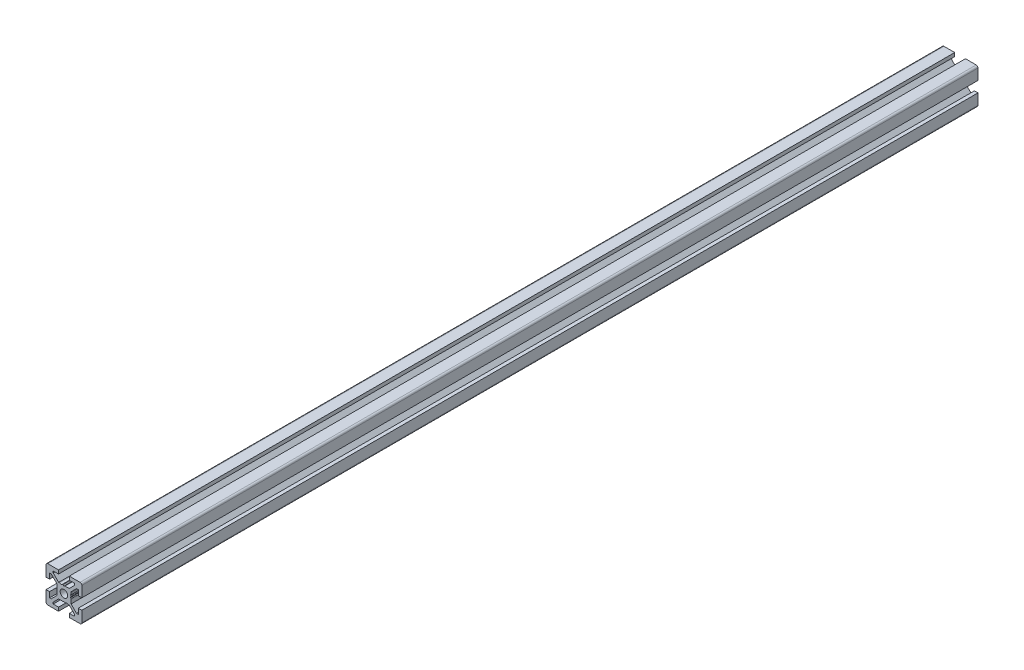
from build123d import *

# Parameters (mm, degrees)
SKETCH_1_R      = 2.1
EXTRUDE_1_DEPTH = 500


with BuildPart() as part:
    # Sketch 1 → Extrude 1 (new body)
    with BuildSketch(Plane(origin=(0, 0, -500), x_dir=(-1, 0, 0), z_dir=(0, 0, -1))):
        with BuildLine():
            Line((10, -3), (8, -3))
            Line((8, -3), (8, -6))
            Line((8, -6), (7.060660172, -6))
            Line((7.060660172, -6), (4, -2.939339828))
            Line((4, -2.939339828), (4, -2.5))
            Line((4, -2.5), (3.750976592, -1.218885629))
            Line((3.750976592, -1.218885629), (3.933012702, -0.903589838))
            ThreePointArc((3.933012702, -0.903589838), (4, -0.653589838), (3.933012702, -0.403589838))
            Line((3.933012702, -0.403589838), (3.7, 0))
            Line((3.7, 0), (3.933012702, 0.403589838))
            ThreePointArc((3.933012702, 0.403589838), (3.982962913, 0.524180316), (4, 0.653589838))
            Line((4, 0.653589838), (4, 2.939339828))
            Line((4, 2.939339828), (7.060660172, 6))
            Line((7.060660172, 6), (8, 6))
            Line((8, 6), (8, 3))
            Line((8, 3), (10, 3))
            Line((10, 3), (10, 9))
            ThreePointArc((10, 9), (9.707106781, 9.707106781), (9, 10))
            Line((9, 10), (3, 10))
            Line((3, 10), (3, 8))
            Line((3, 8), (6, 8))
            Line((6, 8), (6, 7.060660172))
            Line((6, 7.060660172), (2.939339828, 4))
            Line((2.939339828, 4), (2.5, 4))
            Line((2.5, 4), (1.218885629, 3.750976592))
            Line((1.218885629, 3.750976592), (0.903589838, 3.933012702))
            ThreePointArc((0.903589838, 3.933012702), (0.653589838, 4), (0.403589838, 3.933012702))
            Line((0.403589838, 3.933012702), (0, 3.7))
            Line((0, 3.7), (-0.403589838, 3.933012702))
            ThreePointArc((-0.403589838, 3.933012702), (-0.524180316, 3.982962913), (-0.653589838, 4))
            Line((-0.653589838, 4), (-2.939339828, 4))
            Line((-2.939339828, 4), (-6, 7.060660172))
            Line((-6, 7.060660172), (-6, 8))
            Line((-6, 8), (-3, 8))
            Line((-3, 8), (-3, 10))
            Line((-3, 10), (-9, 10))
            ThreePointArc((-9, 10), (-9.707106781, 9.707106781), (-10, 9))
            Line((-10, 9), (-10, 3))
            Line((-10, 3), (-8, 3))
            Line((-8, 3), (-8, 6))
            Line((-8, 6), (-7.060660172, 6))
            Line((-7.060660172, 6), (-4, 2.939339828))
            Line((-4, 2.939339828), (-4, 2.5))
            Line((-4, 2.5), (-3.750976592, 1.218885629))
            Line((-3.750976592, 1.218885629), (-3.933012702, 0.903589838))
            ThreePointArc((-3.933012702, 0.903589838), (-4, 0.653589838), (-3.933012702, 0.403589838))
            Line((-3.933012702, 0.403589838), (-3.7, 0))
            Line((-3.7, 0), (-3.933012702, -0.403589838))
            ThreePointArc((-3.933012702, -0.403589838), (-3.982962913, -0.524180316), (-4, -0.653589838))
            Line((-4, -0.653589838), (-4, -2.939339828))
            Line((-4, -2.939339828), (-7.060660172, -6))
            Line((-7.060660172, -6), (-8, -6))
            Line((-8, -6), (-8, -3))
            Line((-8, -3), (-10, -3))
            Line((-10, -3), (-10, -9))
            ThreePointArc((-10, -9), (-9.707106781, -9.707106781), (-9, -10))
            Line((-9, -10), (-3, -10))
            Line((-3, -10), (-3, -8))
            Line((-3, -8), (-6, -8))
            Line((-6, -8), (-6, -7.060660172))
            Line((-6, -7.060660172), (-2.939339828, -4))
            Line((-2.939339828, -4), (-2.5, -4))
            Line((-2.5, -4), (-1.218885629, -3.750976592))
            Line((-1.218885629, -3.750976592), (-0.903589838, -3.933012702))
            ThreePointArc((-0.903589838, -3.933012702), (-0.653589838, -4), (-0.403589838, -3.933012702))
            Line((-0.403589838, -3.933012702), (0, -3.7))
            Line((0, -3.7), (0.403589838, -3.933012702))
            ThreePointArc((0.403589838, -3.933012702), (0.524180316, -3.982962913), (0.653589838, -4))
            Line((0.653589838, -4), (2.939339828, -4))
            Line((2.939339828, -4), (6, -7.060660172))
            Line((6, -7.060660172), (6, -8))
            Line((6, -8), (3, -8))
            Line((3, -8), (3, -10))
            Line((3, -10), (9, -10))
            ThreePointArc((9, -10), (9.707106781, -9.707106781), (10, -9))
            Line((10, -9), (10, -3))
        make_face()
        with Locations(Location((0, 0, 0), (0, 0, 180))):
            Circle(SKETCH_1_R, mode=Mode.SUBTRACT)
    extrude(amount=-EXTRUDE_1_DEPTH)


solid = part.part
